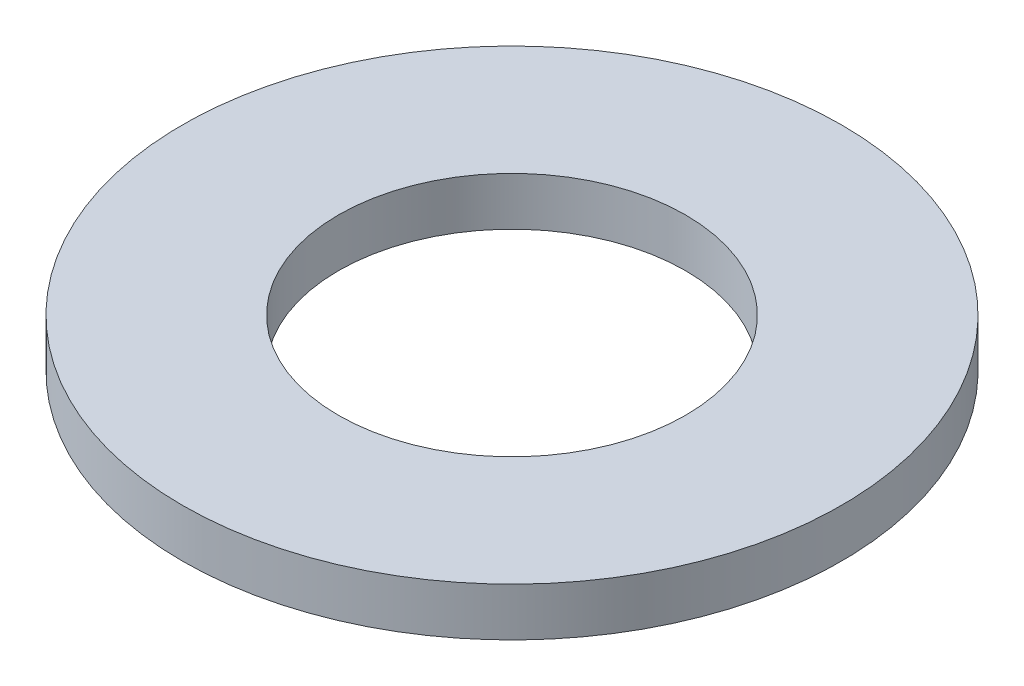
ISO-10303-21;
HEADER;
FILE_DESCRIPTION(('STEP AP214'),'2;1');
FILE_NAME('part.step','',(''),(''),'','','');
FILE_SCHEMA(('AUTOMOTIVE_DESIGN { 1 0 10303 214 1 1 1 1 }'));
ENDSEC;
DATA;
#1=APPLICATION_CONTEXT('core data for automotive mechanical design processes');
#2=APPLICATION_PROTOCOL_DEFINITION('international standard','automotive_design',2000,#1);
#3=PRODUCT_CONTEXT('',#1,'mechanical');
#4=PRODUCT('Part','Part','',(#3));
#5=PRODUCT_RELATED_PRODUCT_CATEGORY('part','',(#4));
#6=PRODUCT_DEFINITION_FORMATION('','',#4);
#7=PRODUCT_DEFINITION_CONTEXT('part definition',#1,'design');
#8=PRODUCT_DEFINITION('design','',#6,#7);
#9=PRODUCT_DEFINITION_SHAPE('','',#8);
#10=(LENGTH_UNIT() NAMED_UNIT(*) SI_UNIT(.MILLI.,.METRE.));
#11=(NAMED_UNIT(*) PLANE_ANGLE_UNIT() SI_UNIT($,.RADIAN.));
#12=(NAMED_UNIT(*) SI_UNIT($,.STERADIAN.) SOLID_ANGLE_UNIT());
#13=UNCERTAINTY_MEASURE_WITH_UNIT(LENGTH_MEASURE(1.E-05),#10,'distance_accuracy_value','');
#14=(GEOMETRIC_REPRESENTATION_CONTEXT(3) GLOBAL_UNCERTAINTY_ASSIGNED_CONTEXT((#13)) GLOBAL_UNIT_ASSIGNED_CONTEXT((#10,
#11,#12)) REPRESENTATION_CONTEXT('',''));
#15=CARTESIAN_POINT('',(0.,0.,0.));
#16=DIRECTION('',(0.,0.,1.));
#17=DIRECTION('',(1.,0.,0.));
#18=AXIS2_PLACEMENT_3D('',#15,#16,#17);
#19=CARTESIAN_POINT('',(0.,2.794,0.));
#20=DIRECTION('',(0.,1.,0.));
#21=DIRECTION('',(0.,0.,1.));
#22=AXIS2_PLACEMENT_3D('',#19,#20,#21);
#23=PLANE('',#22);
#24=CARTESIAN_POINT('',(0.,2.794,0.));
#25=DIRECTION('',(0.,1.,0.));
#26=DIRECTION('',(0.,0.,1.));
#27=AXIS2_PLACEMENT_3D('',#24,#25,#26);
#28=CIRCLE('',#27,19.05);
#29=CARTESIAN_POINT('',(0.,2.794,19.05));
#30=VERTEX_POINT('',#29);
#31=EDGE_CURVE('E10',#30,#30,#28,.T.);
#32=ORIENTED_EDGE('',*,*,#31,.T.);
#33=EDGE_LOOP('',(#32));
#34=FACE_BOUND('',#33,.T.);
#35=CARTESIAN_POINT('',(0.,2.794,0.));
#36=DIRECTION('',(0.,1.,0.));
#37=DIRECTION('',(0.,0.,1.));
#38=AXIS2_PLACEMENT_3D('',#35,#36,#37);
#39=CIRCLE('',#38,10.033);
#40=CARTESIAN_POINT('',(0.,2.794,10.033));
#41=VERTEX_POINT('',#40);
#42=EDGE_CURVE('E35',#41,#41,#39,.T.);
#43=ORIENTED_EDGE('',*,*,#42,.F.);
#44=EDGE_LOOP('',(#43));
#45=FACE_BOUND('',#44,.T.);
#46=ADVANCED_FACE('F24',(#34,#45),#23,.T.);
#47=CARTESIAN_POINT('',(0.,0.,0.));
#48=DIRECTION('',(0.,1.,0.));
#49=DIRECTION('',(0.,0.,1.));
#50=AXIS2_PLACEMENT_3D('',#47,#48,#49);
#51=PLANE('',#50);
#52=CARTESIAN_POINT('',(0.,0.,0.));
#53=DIRECTION('',(0.,1.,0.));
#54=DIRECTION('',(0.,0.,1.));
#55=AXIS2_PLACEMENT_3D('',#52,#53,#54);
#56=CIRCLE('',#55,19.05);
#57=CARTESIAN_POINT('',(0.,0.,19.05));
#58=VERTEX_POINT('',#57);
#59=EDGE_CURVE('E31',#58,#58,#56,.T.);
#60=ORIENTED_EDGE('',*,*,#59,.F.);
#61=EDGE_LOOP('',(#60));
#62=FACE_BOUND('',#61,.T.);
#63=CARTESIAN_POINT('',(0.,0.,0.));
#64=DIRECTION('',(0.,1.,0.));
#65=DIRECTION('',(0.,0.,1.));
#66=AXIS2_PLACEMENT_3D('',#63,#64,#65);
#67=CIRCLE('',#66,10.033);
#68=CARTESIAN_POINT('',(0.,0.,10.033));
#69=VERTEX_POINT('',#68);
#70=EDGE_CURVE('E39',#69,#69,#67,.T.);
#71=ORIENTED_EDGE('',*,*,#70,.T.);
#72=EDGE_LOOP('',(#71));
#73=FACE_BOUND('',#72,.T.);
#74=ADVANCED_FACE('F45',(#62,#73),#51,.F.);
#75=CARTESIAN_POINT('',(0.,2.794,0.));
#76=DIRECTION('',(0.,-1.,0.));
#77=DIRECTION('',(0.,0.,-1.));
#78=AXIS2_PLACEMENT_3D('',#75,#76,#77);
#79=CYLINDRICAL_SURFACE('',#78,19.05);
#80=ORIENTED_EDGE('',*,*,#31,.F.);
#81=EDGE_LOOP('',(#80));
#82=FACE_BOUND('',#81,.T.);
#83=ORIENTED_EDGE('',*,*,#59,.T.);
#84=EDGE_LOOP('',(#83));
#85=FACE_BOUND('',#84,.T.);
#86=ADVANCED_FACE('F26',(#82,#85),#79,.T.);
#87=CARTESIAN_POINT('',(0.,2.794,0.));
#88=DIRECTION('',(0.,-1.,0.));
#89=DIRECTION('',(0.,0.,-1.));
#90=AXIS2_PLACEMENT_3D('',#87,#88,#89);
#91=CYLINDRICAL_SURFACE('',#90,10.033);
#92=ORIENTED_EDGE('',*,*,#42,.T.);
#93=EDGE_LOOP('',(#92));
#94=FACE_BOUND('',#93,.T.);
#95=ORIENTED_EDGE('',*,*,#70,.F.);
#96=EDGE_LOOP('',(#95));
#97=FACE_BOUND('',#96,.T.);
#98=ADVANCED_FACE('F47',(#94,#97),#91,.F.);
#99=CLOSED_SHELL('',(#46,#74,#86,#98));
#100=MANIFOLD_SOLID_BREP('B2',#99);
#101=ADVANCED_BREP_SHAPE_REPRESENTATION('',(#18,#100),#14);
#102=SHAPE_DEFINITION_REPRESENTATION(#9,#101);
ENDSEC;
END-ISO-10303-21;
